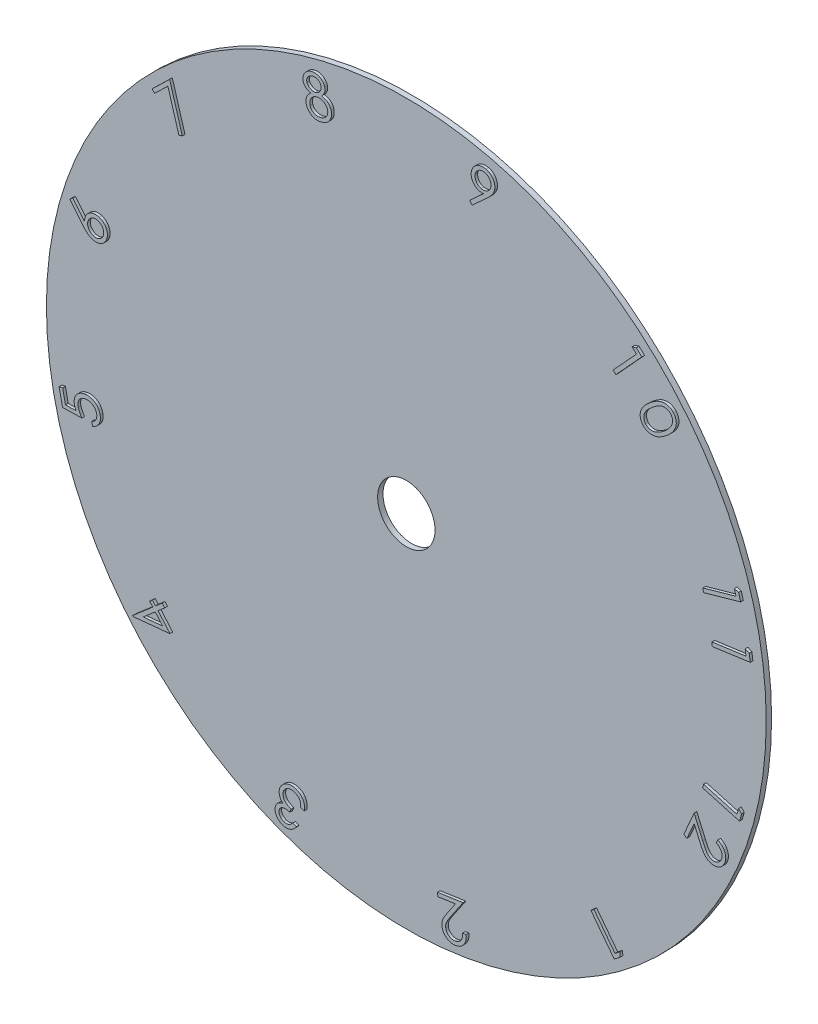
from build123d import *

# Parameters (mm, degrees)
SKETCH1_R           = 134.355713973
BASE_EXTRUDE_DEPTH  = 2
BOSS_EXTRUDE1_DEPTH = 1
SKETCH3_R           = 10.711126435
CUT_EXTRUDE1_DEPTH  = 191.018198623


with BuildPart() as part:
    # Sketch1 → Base-Extrude (new body)
    with BuildSketch(Plane.XY):
        Circle(SKETCH1_R)
    extrude(amount=BASE_EXTRUDE_DEPTH)

    # Sketch2 → Boss-Extrude1 (add)
    # profile 1 of 15: a face of its own
    with BuildSketch(Plane.XY.offset(2)):
        Polygon((128.998970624, 19.866427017), (129.384416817, 17.08488621), (115.235089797, 15.120261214), (115.039490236, 16.52685217), (127.802361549, 18.29875407), (127.494579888, 20.519384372), align=None)
    # profile 2 of 15: a face of its own
    with BuildSketch(Plane.XY.offset(2)):
        Polygon((125.024778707, 37.532719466), (125.795671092, 34.831719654), (112.043296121, 30.913975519), (111.654973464, 32.277419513), (124.061163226, 35.81259392), (123.445599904, 37.972818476), align=None)
    # profile 3 of 15: a face of its own
    with BuildSketch(Plane.XY.offset(2)):
        with BuildLine():
            add(Edge.make_bspline(
                [(91.977572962, 82.303282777), (92.153838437, 82.447567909), (92.496024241, 82.727669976), (93.013268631, 83.112589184), (93.509222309, 83.461303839), (93.986920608, 83.769582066), (94.444595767, 84.039513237), (94.885398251, 84.26578334), (95.304666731, 84.459813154), (95.711261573, 84.605508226), (96.101966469, 84.72257359), (96.483659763, 84.808978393), (96.857360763, 84.869852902), (97.222512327, 84.904386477), (97.579263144, 84.914693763), (97.928246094, 84.893139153), (98.270229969, 84.849187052), (98.602291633, 84.772216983), (98.922329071, 84.675315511), (99.231390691, 84.557815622), (99.522923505, 84.411113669), (99.807606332, 84.253259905), (100.071573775, 84.063472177), (100.32356651, 83.855193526), (100.563677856, 83.625750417), (100.709030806, 83.456112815), (100.782429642, 83.370450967)],
                knots=[0, 0, 0, 0, 1.643594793, 3.190725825, 4.651477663, 6.017995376, 7.292516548, 8.483943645, 9.592569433, 10.623528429, 11.597758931, 12.534382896, 13.445537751, 14.328188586, 15.179501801, 16.018123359, 16.848915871, 17.664705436, 18.474575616, 19.260961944, 20.046952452, 20.827932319, 21.607347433, 22.388725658, 23.186355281, 24, 24, 24, 24], degree=3))
            add(Edge.make_bspline(
                [(100.782429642, 83.370450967), (100.852882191, 83.281368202), (100.992978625, 83.104225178), (101.176476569, 82.822081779), (101.334764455, 82.530087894), (101.472052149, 82.230124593), (101.57990627, 81.918439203), (101.667655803, 81.598784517), (101.727228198, 81.268496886), (101.764636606, 80.930272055), (101.777836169, 80.583900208), (101.755373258, 80.232949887), (101.709706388, 79.877154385), (101.635501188, 79.516960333), (101.526209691, 79.154000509), (101.394373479, 78.784589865), (101.232645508, 78.411038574), (101.042057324, 78.031780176), (100.816532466, 77.648271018), (100.553730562, 77.258931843), (100.250521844, 76.864690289), (99.906234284, 76.464798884), (99.524891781, 76.057258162), (99.101881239, 75.645517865), (98.643742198, 75.225591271), (98.317445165, 74.95264733), (98.150464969, 74.812970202)],
                knots=[0, 0, 0, 0, 0.813469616, 1.617602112, 2.407701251, 3.191773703, 3.978340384, 4.768290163, 5.564666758, 6.380251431, 7.205129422, 8.044668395, 8.896818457, 9.773969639, 10.67616155, 11.610605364, 12.583067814, 13.590830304, 14.650106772, 15.768615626, 16.954471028, 18.211580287, 19.548229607, 20.952250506, 22.440335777, 24, 24, 24, 24], degree=3))
            add(Edge.make_bspline(
                [(98.150464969, 74.812970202), (97.981993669, 74.67521732), (97.653749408, 74.406823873), (97.153927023, 74.041601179), (96.675224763, 73.703926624), (96.204112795, 73.41098929), (95.748169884, 73.151139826), (95.304759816, 72.928865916), (94.875840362, 72.7432237), (94.459174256, 72.596117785), (94.054700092, 72.479917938), (93.659577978, 72.394030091), (93.2736895, 72.331876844), (92.895776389, 72.30081519), (92.527695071, 72.294554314), (92.167958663, 72.314129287), (91.817480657, 72.362254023), (91.477767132, 72.44158119), (91.149417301, 72.541093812), (90.835862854, 72.666198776), (90.533773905, 72.808571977), (90.25103449, 72.980800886), (89.976655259, 73.166674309), (89.722445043, 73.381544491), (89.477960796, 73.614031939), (89.330760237, 73.785693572), (89.256437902, 73.872366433)],
                knots=[0, 0, 0, 0, 1.56060438, 3.04063323, 4.439029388, 5.761423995, 7.017941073, 8.202057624, 9.317306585, 10.367915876, 11.36926761, 12.333784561, 13.266592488, 14.170690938, 15.051094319, 15.905238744, 16.752377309, 17.584873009, 18.405005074, 19.21085467, 20.004461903, 20.797055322, 21.583027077, 22.37904437, 23.181570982, 24, 24, 24, 24], degree=3))
            add(Edge.make_bspline(
                [(89.256437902, 73.872366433), (89.186998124, 73.960541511), (89.049411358, 74.135250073), (88.868055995, 74.413458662), (88.709114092, 74.699037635), (88.579947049, 74.996878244), (88.469649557, 75.299790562), (88.386369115, 75.613763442), (88.325336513, 75.935693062), (88.29144475, 76.266677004), (88.28224329, 76.604257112), (88.302243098, 76.945946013), (88.353461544, 77.291612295), (88.426499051, 77.641199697), (88.532237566, 77.994454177), (88.66422465, 78.351210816), (88.827048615, 78.710326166), (89.014431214, 79.077303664), (89.24060829, 79.449029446), (89.506103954, 79.829923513), (89.816269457, 80.217500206), (90.16515219, 80.618055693), (90.555455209, 81.029197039), (90.992669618, 81.444830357), (91.467053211, 81.875193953), (91.803990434, 82.157727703), (91.977572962, 82.303282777)],
                knots=[0, 0, 0, 0, 0.810584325, 1.606077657, 2.396729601, 3.169080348, 3.949190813, 4.72389932, 5.513336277, 6.314361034, 7.125182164, 7.951017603, 8.783797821, 9.647971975, 10.529194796, 11.445449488, 12.394358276, 13.376570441, 14.420926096, 15.535594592, 16.728990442, 18.005702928, 19.372872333, 20.823187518, 22.363377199, 24, 24, 24, 24], degree=3))
        make_face()
        with BuildLine():
            add(Edge.make_bspline(
                [(92.811747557, 81.250496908), (92.662478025, 81.125651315), (92.373575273, 80.884019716), (91.964199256, 80.520296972), (91.59050532, 80.171709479), (91.255513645, 79.833200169), (90.955028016, 79.509673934), (90.693965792, 79.195176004), (90.464628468, 78.898287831), (90.275206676, 78.608735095), (90.115566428, 78.327729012), (89.9808424, 78.050395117), (89.862709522, 77.777398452), (89.775504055, 77.502930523), (89.704739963, 77.232544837), (89.658423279, 76.963143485), (89.635106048, 76.6956176), (89.635836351, 76.347735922), (89.683033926, 75.93092074), (89.806558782, 75.459624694), (90.000628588, 75.026309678), (90.187403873, 74.776398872), (90.280459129, 74.651888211)],
                knots=[0, 0, 0, 0, 1.477605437, 2.859821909, 4.15786153, 5.357439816, 6.475593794, 7.509427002, 8.460327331, 9.322611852, 10.134486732, 10.912723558, 11.663219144, 12.390796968, 13.097154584, 13.784224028, 14.463846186, 15.133686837, 16.42336831, 17.636677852, 18.822544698, 20, 20, 20, 20], degree=3))
            add(Edge.make_bspline(
                [(90.280459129, 74.651888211), (90.384943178, 74.536489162), (90.593833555, 74.305776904), (90.979475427, 74.032814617), (91.410400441, 73.816451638), (91.806371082, 73.694702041), (92.141686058, 73.629437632), (92.404610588, 73.603588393), (92.673929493, 73.601955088), (92.950970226, 73.61849828), (93.234330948, 73.659814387), (93.524628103, 73.720599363), (93.821687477, 73.804018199), (94.01933903, 73.875855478), (94.120538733, 73.912636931)],
                knots=[0, 0, 0, 0, 1.334797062, 2.668601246, 4.032475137, 5.466286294, 6.213128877, 6.966853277, 7.73344751, 8.526268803, 9.350392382, 10.192618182, 11.074601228, 12, 12, 12, 12], degree=3))
            add(Edge.make_bspline(
                [(94.120538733, 73.912636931), (94.247769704, 73.960898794), (94.507410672, 74.059387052), (94.890724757, 74.240034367), (95.279389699, 74.44139051), (95.673000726, 74.666182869), (96.068170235, 74.920896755), (96.471605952, 75.196034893), (96.877857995, 75.499123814), (97.145374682, 75.715276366), (97.281772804, 75.825485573)],
                knots=[0, 0, 0, 0, 0.879510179, 1.794821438, 2.737538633, 3.709460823, 4.724097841, 5.776441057, 6.866279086, 8, 8, 8, 8], degree=3))
            add(Edge.make_bspline(
                [(97.281772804, 75.825485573), (97.415691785, 75.937875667), (97.677031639, 76.157202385), (98.049158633, 76.491103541), (98.391875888, 76.822862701), (98.708072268, 77.148651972), (98.994445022, 77.47265603), (99.252557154, 77.791985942), (99.488076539, 78.103927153), (99.688605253, 78.416242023), (99.865456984, 78.722372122), (100.017726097, 79.02275979), (100.145296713, 79.318667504), (100.250254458, 79.607050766), (100.324341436, 79.891537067), (100.378026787, 80.168075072), (100.403402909, 80.439729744), (100.407286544, 80.7875374), (100.361708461, 81.203721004), (100.238573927, 81.671812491), (100.046242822, 82.101974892), (99.861964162, 82.349401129), (99.76991427, 82.472994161)],
                knots=[0, 0, 0, 0, 1.328964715, 2.593444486, 3.79963132, 4.954287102, 6.043820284, 7.085391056, 8.075206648, 9.013271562, 9.904671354, 10.761954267, 11.571623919, 12.35314833, 13.092152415, 13.804061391, 14.492332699, 15.162933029, 16.445951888, 17.660565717, 18.831418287, 20, 20, 20, 20], degree=3))
            add(Edge.make_bspline(
                [(99.76991427, 82.472994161), (99.664438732, 82.588381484), (99.453493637, 82.819149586), (99.064485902, 83.092923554), (98.628209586, 83.308300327), (98.228545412, 83.429966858), (97.890310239, 83.495042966), (97.625792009, 83.524074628), (97.354377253, 83.52971388), (97.076599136, 83.511216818), (96.792246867, 83.47359251), (96.500660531, 83.416651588), (96.203758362, 83.333718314), (95.895887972, 83.234251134), (95.576816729, 83.101359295), (95.238457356, 82.940619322), (94.88356157, 82.739666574), (94.505728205, 82.509692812), (94.109022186, 82.244025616), (93.693321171, 81.944860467), (93.25634341, 81.612688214), (92.963493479, 81.374117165), (92.811747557, 81.250496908)],
                knots=[0, 0, 0, 0, 1.184946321, 2.369825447, 3.58842841, 4.869712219, 5.529859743, 6.204089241, 6.889097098, 7.589886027, 8.317359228, 9.067500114, 9.8451578, 10.658448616, 11.524340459, 12.469373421, 13.503245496, 14.621565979, 15.829933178, 17.129991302, 18.512848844, 20, 20, 20, 20], degree=3))
        make_face(mode=Mode.SUBTRACT)
    # profile 4 of 15: a face of its own
    with BuildSketch(Plane.XY.offset(2)):
        Polygon((86.861899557, 97.509117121), (88.938706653, 95.607774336), (79.242146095, 85.028139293), (78.192236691, 85.98887831), (86.939564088, 95.532986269), (85.279844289, 97.05463579), align=None)
    # profile 5 of 15: a face of its own
    with BuildSketch(Plane.XY.offset(2)):
        with BuildLine():
            Line((25.606764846, 113.009631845), (24.643149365, 114.022147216))
            Line((24.643149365, 114.022147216), (29.771884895, 118.791324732))
            add(Edge.make_bspline(
                [(29.771884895, 118.791324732), (29.639611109, 118.783497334), (29.380875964, 118.768186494), (29.000959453, 118.780644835), (28.639928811, 118.818974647), (28.40907598, 118.86802849), (28.2962588, 118.892000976)],
                knots=[0, 0, 0, 0, 1.070377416, 2.093719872, 3.068405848, 4, 4, 4, 4], degree=3))
            add(Edge.make_bspline(
                [(28.2962588, 118.892000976), (28.162189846, 118.928831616), (27.897731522, 119.001482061), (27.519535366, 119.152063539), (27.166098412, 119.336326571), (26.839894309, 119.557486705), (26.53534164, 119.80783715), (26.258198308, 120.095713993), (26.004916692, 120.415544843), (25.77881542, 120.765344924), (25.58573012, 121.135230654), (25.426754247, 121.517366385), (25.3163435, 121.910933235), (25.240226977, 122.311210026), (25.205709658, 122.71991644), (25.212564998, 123.136865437), (25.25708544, 123.562910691), (25.319252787, 123.845750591), (25.350759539, 123.989095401)],
                knots=[0, 0, 0, 0, 1.016698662, 2.005493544, 2.972011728, 3.927389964, 4.884029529, 5.851489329, 6.845249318, 7.864920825, 8.894176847, 9.894723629, 10.887294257, 11.879368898, 12.872137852, 13.882474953, 14.926826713, 16, 16, 16, 16], degree=3))
            add(Edge.make_bspline(
                [(25.350759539, 123.989095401), (25.403774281, 124.182788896), (25.508072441, 124.563850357), (25.756545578, 125.09478264), (26.055400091, 125.58567624), (26.423062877, 126.02232456), (26.843036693, 126.406621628), (27.314590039, 126.728002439), (27.830048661, 126.989717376), (28.387327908, 127.17946614), (28.966811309, 127.303019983), (29.55527593, 127.352796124), (30.145042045, 127.326357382), (30.530094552, 127.247545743), (30.72399452, 127.207858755)],
                knots=[0, 0, 0, 0, 1.034175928, 2.034578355, 3.011825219, 3.991484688, 4.968293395, 5.93957698, 6.926091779, 7.941216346, 8.967521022, 9.975062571, 10.980307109, 12, 12, 12, 12], degree=3))
            add(Edge.make_bspline(
                [(30.72399452, 127.207858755), (30.91170068, 127.155236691), (31.282242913, 127.051357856), (31.804826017, 126.811100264), (32.286429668, 126.505940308), (32.724653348, 126.140955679), (33.115808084, 125.726246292), (33.435527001, 125.25719299), (33.695429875, 124.749600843), (33.881797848, 124.204672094), (34.003707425, 123.640729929), (34.049649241, 123.069354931), (34.023321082, 122.497163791), (33.946782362, 122.123475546), (33.908240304, 121.935300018)],
                knots=[0, 0, 0, 0, 1.022283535, 2.018043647, 3.006869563, 4.007884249, 5.00524651, 5.989718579, 6.978095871, 7.990664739, 9.00469674, 9.999705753, 10.992726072, 12, 12, 12, 12], degree=3))
            add(Edge.make_bspline(
                [(33.908240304, 121.935300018), (33.869066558, 121.791435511), (33.789062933, 121.497624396), (33.609282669, 121.068038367), (33.39019876, 120.636576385), (33.169217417, 120.282220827), (32.969253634, 119.993534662), (32.795109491, 119.769063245), (32.602127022, 119.536107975), (32.38982079, 119.294720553), (32.155692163, 119.047239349), (31.902327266, 118.792342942), (31.631929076, 118.525613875), (31.440780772, 118.349691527), (31.342434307, 118.259178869)],
                knots=[0, 0, 0, 0, 1.178454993, 2.406731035, 3.675468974, 5.003758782, 5.706574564, 6.453021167, 7.250377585, 8.099521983, 8.99564451, 9.945016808, 10.942704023, 12, 12, 12, 12], degree=3))
            Line((31.342434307, 118.259178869), (25.606764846, 113.009631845))
        make_face()
        with BuildLine():
            add(Edge.make_bspline(
                [(28.914698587, 120.031080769), (29.015002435, 120.008734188), (29.212242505, 119.964791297), (29.511441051, 119.937640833), (29.805169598, 119.936886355), (30.094346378, 119.965744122), (30.377650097, 120.023669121), (30.656540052, 120.110472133), (30.9296841, 120.229348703), (31.194897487, 120.375474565), (31.447589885, 120.543154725), (31.676626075, 120.734337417), (31.887341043, 120.938052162), (32.067210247, 121.164473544), (32.228162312, 121.404908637), (32.363043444, 121.664324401), (32.473369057, 121.942156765), (32.526480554, 122.136072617), (32.553425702, 122.234452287)],
                knots=[0, 0, 0, 0, 1.041559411, 2.04814924, 3.040301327, 4.017850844, 4.990743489, 5.969066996, 6.975515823, 8.007217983, 9.037773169, 10.046569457, 11.030149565, 12.005421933, 12.973928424, 13.961540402, 14.965824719, 16, 16, 16, 16], degree=3))
            add(Edge.make_bspline(
                [(32.553425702, 122.234452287), (32.574270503, 122.33388025), (32.615503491, 122.530558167), (32.64758941, 122.827094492), (32.648513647, 123.119452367), (32.614417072, 123.406102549), (32.55911974, 123.689388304), (32.467339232, 123.967084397), (32.349647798, 124.240851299), (32.203411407, 124.506180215), (32.035171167, 124.757540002), (31.847609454, 124.989779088), (31.640445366, 125.197246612), (31.414144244, 125.379474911), (31.171295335, 125.538366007), (30.911645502, 125.674275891), (30.632885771, 125.784967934), (30.437905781, 125.837686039), (30.338548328, 125.86455001)],
                knots=[0, 0, 0, 0, 1.030638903, 2.038701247, 3.021600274, 3.990964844, 4.964326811, 5.946068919, 6.953003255, 7.985203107, 9.016255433, 10.01937338, 11.010285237, 11.986028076, 12.963128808, 13.951217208, 14.955985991, 16, 16, 16, 16], degree=3))
            add(Edge.make_bspline(
                [(30.338548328, 125.86455001), (30.239120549, 125.885394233), (30.042442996, 125.92662608), (29.745904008, 125.958720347), (29.453555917, 125.959613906), (29.166869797, 125.925630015), (28.882821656, 125.86973381), (28.603784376, 125.779115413), (28.329311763, 125.660679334), (28.063885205, 125.514607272), (27.812776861, 125.346105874), (27.5801855, 125.159821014), (27.37683006, 124.950679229), (27.192557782, 124.728031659), (27.035105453, 124.486448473), (26.901396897, 124.227180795), (26.791340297, 123.950609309), (26.738257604, 123.756685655), (26.711327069, 123.658302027)],
                knots=[0, 0, 0, 0, 1.032420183, 2.042224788, 3.026822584, 3.997862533, 4.972906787, 5.965626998, 6.974301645, 8.008285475, 9.041119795, 10.045971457, 11.03172681, 12.001591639, 12.980381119, 13.957032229, 14.96353758, 16, 16, 16, 16], degree=3))
            add(Edge.make_bspline(
                [(26.711327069, 123.658302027), (26.688959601, 123.558961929), (26.644775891, 123.362729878), (26.618022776, 123.065386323), (26.617075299, 122.773579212), (26.646181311, 122.486327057), (26.704399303, 122.203179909), (26.790079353, 121.922967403), (26.909680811, 121.649103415), (27.055659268, 121.38380936), (27.223558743, 121.131314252), (27.413597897, 120.902114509), (27.619305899, 120.694304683), (27.844700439, 120.514508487), (28.084398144, 120.352923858), (28.345400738, 120.222122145), (28.622293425, 120.110922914), (28.816282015, 120.057953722), (28.914698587, 120.031080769)],
                knots=[0, 0, 0, 0, 1.034027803, 2.042572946, 3.026906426, 3.996657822, 4.971440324, 5.960970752, 6.969374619, 8.003080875, 9.035637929, 10.046393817, 11.024969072, 12.00213592, 12.972523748, 13.957580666, 14.96381582, 16, 16, 16, 16], degree=3))
        make_face(mode=Mode.SUBTRACT)
    # profile 6 of 15: a face of its own
    with BuildSketch(Plane.XY.offset(2)):
        with BuildLine():
            add(Edge.make_bspline(
                [(-30.643406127, 120.206725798), (-30.515600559, 120.18016548), (-30.265264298, 120.128141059), (-29.903889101, 120.031086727), (-29.565667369, 119.91749872), (-29.250071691, 119.795311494), (-28.957063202, 119.660407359), (-28.689301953, 119.50910792), (-28.440392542, 119.350502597), (-28.14759003, 119.115539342), (-27.820091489, 118.793426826), (-27.494961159, 118.351039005), (-27.2365643, 117.856081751), (-27.124876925, 117.498236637), (-27.067961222, 117.315879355)],
                knots=[0, 0, 0, 0, 0.963010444, 1.886274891, 2.758759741, 3.594295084, 4.382391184, 5.13617812, 5.862198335, 6.557153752, 7.90280826, 9.238514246, 10.592751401, 12, 12, 12, 12], degree=3))
            add(Edge.make_bspline(
                [(-27.067961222, 117.315879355), (-27.035918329, 117.184025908), (-26.972765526, 116.924158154), (-26.918993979, 116.529292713), (-26.897403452, 116.137589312), (-26.915457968, 115.748528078), (-26.968001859, 115.362673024), (-27.053486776, 114.979967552), (-27.17848589, 114.600091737), (-27.286438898, 114.354215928), (-27.341225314, 114.229433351)],
                knots=[0, 0, 0, 0, 1.028104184, 2.026273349, 3.016150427, 3.998418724, 4.973994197, 5.965044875, 6.96725528, 8, 8, 8, 8], degree=3))
            add(Edge.make_bspline(
                [(-27.341225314, 114.229433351), (-27.41702131, 114.080497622), (-27.567735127, 113.784351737), (-27.860575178, 113.380736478), (-28.195907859, 113.012565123), (-28.579161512, 112.682146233), (-29.010495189, 112.391170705), (-29.488951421, 112.139145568), (-30.011115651, 111.916530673), (-30.383187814, 111.808372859), (-30.574370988, 111.752797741)],
                knots=[0, 0, 0, 0, 0.951607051, 1.892188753, 2.832532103, 3.786053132, 4.770147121, 5.79247988, 6.865702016, 8, 8, 8, 8], degree=3))
            add(Edge.make_bspline(
                [(-30.574370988, 111.752797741), (-30.759733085, 111.706504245), (-31.120167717, 111.616487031), (-31.657350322, 111.537142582), (-32.171531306, 111.500999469), (-32.662941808, 111.526699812), (-33.131708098, 111.592106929), (-33.575998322, 111.716036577), (-33.998853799, 111.883961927), (-34.390810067, 112.108252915), (-34.7526223, 112.363507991), (-35.086143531, 112.637774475), (-35.385897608, 112.930161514), (-35.648917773, 113.242917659), (-35.878606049, 113.572469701), (-36.070848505, 113.921936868), (-36.231858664, 114.288363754), (-36.308781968, 114.543970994), (-36.347434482, 114.672408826)],
                knots=[0, 0, 0, 0, 1.264872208, 2.459530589, 3.592224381, 4.673145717, 5.713291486, 6.720993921, 7.721142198, 8.719291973, 9.704260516, 10.651652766, 11.576856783, 12.473834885, 13.354748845, 14.23320948, 15.11222099, 16, 16, 16, 16], degree=3))
            add(Edge.make_bspline(
                [(-36.347434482, 114.672408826), (-36.391867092, 114.861295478), (-36.479468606, 115.233696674), (-36.504307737, 115.804086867), (-36.450800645, 116.365415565), (-36.33236754, 116.824546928), (-36.191362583, 117.185348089), (-36.058861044, 117.460176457), (-35.895334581, 117.733347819), (-35.708935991, 118.010368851), (-35.49201456, 118.28660427), (-35.246800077, 118.561979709), (-34.975564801, 118.838861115), (-34.781500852, 119.018600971), (-34.681961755, 119.110792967)],
                knots=[0, 0, 0, 0, 1.386721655, 2.734003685, 4.065345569, 5.412365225, 6.112254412, 6.836857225, 7.593903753, 8.389794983, 9.226109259, 10.106351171, 11.028711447, 12, 12, 12, 12], degree=3))
            add(Edge.make_bspline(
                [(-34.681961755, 119.110792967), (-34.866366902, 119.156402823), (-35.22220277, 119.244413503), (-35.720831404, 119.442134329), (-36.163874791, 119.689999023), (-36.552212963, 119.984422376), (-36.882889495, 120.320436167), (-37.154359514, 120.69066992), (-37.37115596, 121.091672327), (-37.461322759, 121.379470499), (-37.506649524, 121.524146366)],
                knots=[0, 0, 0, 0, 1.163333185, 2.24481627, 3.276281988, 4.265967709, 5.221781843, 6.155072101, 7.072556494, 8, 8, 8, 8], degree=3))
            add(Edge.make_bspline(
                [(-37.506649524, 121.524146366), (-37.540358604, 121.674942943), (-37.608256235, 121.978680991), (-37.61997284, 122.452700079), (-37.571064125, 122.938170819), (-37.452179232, 123.429238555), (-37.27129957, 123.912399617), (-37.019869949, 124.370062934), (-36.704373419, 124.793922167), (-36.328819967, 125.181586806), (-35.906854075, 125.527671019), (-35.442393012, 125.820593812), (-34.940938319, 126.057346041), (-34.585734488, 126.16625109), (-34.405821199, 126.221412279)],
                knots=[0, 0, 0, 0, 0.890894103, 1.794460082, 2.724353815, 3.703860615, 4.704935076, 5.696584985, 6.710346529, 7.748559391, 8.807550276, 9.855706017, 10.913899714, 12, 12, 12, 12], degree=3))
            add(Edge.make_bspline(
                [(-34.405821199, 126.221412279), (-34.228283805, 126.263323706), (-33.876345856, 126.346406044), (-33.338253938, 126.390814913), (-32.804025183, 126.367391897), (-32.279235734, 126.278633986), (-31.774080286, 126.126406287), (-31.29970049, 125.917635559), (-30.864465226, 125.645571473), (-30.474729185, 125.318502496), (-30.129058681, 124.953365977), (-29.84450088, 124.552705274), (-29.620361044, 124.123021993), (-29.523917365, 123.81744714), (-29.475561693, 123.664235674)],
                knots=[0, 0, 0, 0, 1.064634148, 2.110457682, 3.142202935, 4.181977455, 5.211667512, 6.217303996, 7.201251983, 8.199685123, 9.182580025, 10.130762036, 11.062787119, 12, 12, 12, 12], degree=3))
            add(Edge.make_bspline(
                [(-29.475561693, 123.664235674), (-29.440456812, 123.510610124), (-29.371507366, 123.208874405), (-29.345208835, 122.749478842), (-29.393379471, 122.299764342), (-29.506167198, 121.859605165), (-29.688393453, 121.428047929), (-29.939192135, 121.006509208), (-30.257689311, 120.591862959), (-30.511805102, 120.338129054), (-30.643406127, 120.206725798)],
                knots=[0, 0, 0, 0, 0.98126058, 1.92729247, 2.852837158, 3.790903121, 4.750120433, 5.763044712, 6.841529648, 8, 8, 8, 8], degree=3))
        make_face()
        with BuildLine():
            add(Edge.make_bspline(
                [(-34.106668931, 124.866597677), (-34.198263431, 124.839329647), (-34.378125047, 124.785784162), (-34.634865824, 124.681232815), (-34.874627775, 124.560387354), (-35.096887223, 124.42282251), (-35.300708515, 124.265172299), (-35.486508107, 124.090746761), (-35.655896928, 123.898701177), (-35.803423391, 123.69088213), (-35.928501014, 123.473202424), (-36.033854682, 123.253911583), (-36.113629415, 123.031604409), (-36.15953019, 122.8056891), (-36.192118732, 122.579891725), (-36.190096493, 122.350862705), (-36.1648802, 122.120398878), (-36.12942967, 121.968754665), (-36.111564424, 121.892333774)],
                knots=[0, 0, 0, 0, 1.148658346, 2.255588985, 3.328117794, 4.374293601, 5.393630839, 6.421410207, 7.4344681, 8.46785868, 9.480391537, 10.450000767, 11.390801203, 12.311245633, 13.217938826, 14.128801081, 15.057011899, 16, 16, 16, 16], degree=3))
            add(Edge.make_bspline(
                [(-36.111564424, 121.892333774), (-36.088445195, 121.816874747), (-36.04268187, 121.667507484), (-35.942366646, 121.455805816), (-35.821003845, 121.256189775), (-35.676153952, 121.067313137), (-35.506015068, 120.893197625), (-35.313903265, 120.729711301), (-35.097093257, 120.581159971), (-34.861831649, 120.444914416), (-34.614000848, 120.32717376), (-34.359265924, 120.235762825), (-34.103105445, 120.164058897), (-33.843196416, 120.126019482), (-33.583394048, 120.107039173), (-33.321373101, 120.116816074), (-33.057092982, 120.149950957), (-32.882857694, 120.193430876), (-32.795001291, 120.215355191)],
                knots=[0, 0, 0, 0, 0.923443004, 1.827907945, 2.735158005, 3.656207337, 4.609361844, 5.581517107, 6.606539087, 7.683414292, 8.76362285, 9.815311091, 10.850619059, 11.873608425, 12.886684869, 13.898078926, 14.940127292, 16, 16, 16, 16], degree=3))
            add(Edge.make_bspline(
                [(-32.795001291, 120.215355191), (-32.683604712, 120.249770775), (-32.461847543, 120.318281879), (-32.149113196, 120.474306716), (-31.857565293, 120.667748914), (-31.59031485, 120.897303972), (-31.356122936, 121.157798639), (-31.157045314, 121.441399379), (-31.00354408, 121.750225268), (-30.894148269, 122.075949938), (-30.820340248, 122.405880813), (-30.796259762, 122.731709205), (-30.80514427, 123.047333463), (-30.852870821, 123.248600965), (-30.876399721, 123.34782462)],
                knots=[0, 0, 0, 0, 1.031552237, 2.053511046, 3.083102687, 4.125199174, 5.165771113, 6.179043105, 7.185777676, 8.209288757, 9.217312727, 10.171799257, 11.098708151, 12, 12, 12, 12], degree=3))
            add(Edge.make_bspline(
                [(-30.876399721, 123.34782462), (-30.896949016, 123.416427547), (-30.93771097, 123.552509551), (-31.025097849, 123.746466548), (-31.134220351, 123.9284326), (-31.256251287, 124.10582191), (-31.404503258, 124.269512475), (-31.572725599, 124.421542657), (-31.758291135, 124.567152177), (-31.962317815, 124.700654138), (-32.183803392, 124.817136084), (-32.420758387, 124.905647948), (-32.670221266, 124.970224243), (-32.933939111, 125.004491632), (-33.21041274, 125.007739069), (-33.499243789, 124.991739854), (-33.800656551, 124.945011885), (-34.002548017, 124.893278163), (-34.106668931, 124.866597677)],
                knots=[0, 0, 0, 0, 0.861270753, 1.708432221, 2.551575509, 3.412846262, 4.29549933, 5.202192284, 6.139435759, 7.131688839, 8.133026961, 9.144685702, 10.169099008, 11.228345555, 12.336442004, 13.49253409, 14.706831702, 16, 16, 16, 16], degree=3))
        make_face(mode=Mode.SUBTRACT)
        with BuildLine():
            add(Edge.make_bspline(
                [(-32.435443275, 118.975599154), (-32.551162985, 118.94111957), (-32.778194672, 118.873473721), (-33.102112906, 118.740261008), (-33.402995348, 118.581870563), (-33.681285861, 118.396349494), (-33.93716426, 118.184987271), (-34.17553302, 117.952937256), (-34.384680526, 117.690567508), (-34.574265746, 117.411700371), (-34.732772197, 117.117716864), (-34.863984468, 116.819918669), (-34.963394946, 116.51975763), (-35.026105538, 116.216568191), (-35.058252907, 115.91300628), (-35.058660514, 115.608266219), (-35.024449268, 115.302340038), (-34.976515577, 115.101553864), (-34.952349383, 115.000325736)],
                knots=[0, 0, 0, 0, 1.108745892, 2.175259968, 3.211554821, 4.227853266, 5.241782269, 6.25704954, 7.27780437, 8.318544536, 9.351239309, 10.341318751, 11.30510996, 12.250080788, 13.180029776, 14.104917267, 15.044577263, 16, 16, 16, 16], degree=3))
            add(Edge.make_bspline(
                [(-34.952349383, 115.000325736), (-34.914042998, 114.876980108), (-34.837493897, 114.630493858), (-34.652549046, 114.28839663), (-34.431574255, 113.963761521), (-34.157479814, 113.672989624), (-33.846885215, 113.41664096), (-33.498605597, 113.210788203), (-33.122894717, 113.050806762), (-32.716808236, 112.945323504), (-32.287561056, 112.890500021), (-31.839621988, 112.893130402), (-31.374975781, 112.943252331), (-31.066500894, 113.019529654), (-30.908040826, 113.058712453)],
                knots=[0, 0, 0, 0, 0.924488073, 1.847439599, 2.776649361, 3.735404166, 4.703318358, 5.65645587, 6.627371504, 7.623398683, 8.656567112, 9.722706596, 10.830180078, 12, 12, 12, 12], degree=3))
            add(Edge.make_bspline(
                [(-30.908040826, 113.058712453), (-30.786441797, 113.093783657), (-30.548253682, 113.162481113), (-30.212437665, 113.302355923), (-29.901220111, 113.461211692), (-29.616873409, 113.640775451), (-29.359567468, 113.845419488), (-29.129942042, 114.071955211), (-28.926514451, 114.321829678), (-28.752135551, 114.591512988), (-28.607349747, 114.873575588), (-28.490930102, 115.16055223), (-28.404659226, 115.448583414), (-28.345520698, 115.738191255), (-28.31941934, 116.030572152), (-28.326588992, 116.324376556), (-28.359218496, 116.620802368), (-28.407125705, 116.814837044), (-28.431405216, 116.913174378)],
                knots=[0, 0, 0, 0, 1.185583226, 2.322319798, 3.403726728, 4.458506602, 5.469241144, 6.479855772, 7.476584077, 8.483835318, 9.484850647, 10.444618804, 11.383062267, 12.299729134, 13.211180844, 14.128200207, 15.05136647, 16, 16, 16, 16], degree=3))
            add(Edge.make_bspline(
                [(-28.431405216, 116.913174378), (-28.460204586, 117.00684687), (-28.517403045, 117.192889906), (-28.636056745, 117.458847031), (-28.783863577, 117.707047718), (-28.958196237, 117.93964128), (-29.160094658, 118.155261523), (-29.389827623, 118.355153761), (-29.646100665, 118.538846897), (-29.926284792, 118.704193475), (-30.221334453, 118.846603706), (-30.52455707, 118.95999136), (-30.832151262, 119.040236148), (-31.143829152, 119.094421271), (-31.462185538, 119.109322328), (-31.784661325, 119.098587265), (-32.111561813, 119.056063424), (-32.326571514, 119.002646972), (-32.435443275, 118.975599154)],
                knots=[0, 0, 0, 0, 0.942751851, 1.872400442, 2.795243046, 3.718224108, 4.66512351, 5.633242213, 6.645033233, 7.696097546, 8.761171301, 9.794992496, 10.806909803, 11.817479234, 12.834267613, 13.868665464, 14.920782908, 16, 16, 16, 16], degree=3))
        make_face(mode=Mode.SUBTRACT)
    # profile 7 of 15: a face of its own
    with BuildSketch(Plane.XY.offset(2)):
        Polygon((-93.898230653, 90.843995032), (-87.354274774, 97.183721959), (-82.62824422, 81.262493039), (-83.896764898, 80.874170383), (-88.007232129, 94.661062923), (-92.951873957, 89.868873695), align=None)
    # profile 8 of 15: a face of its own
    with BuildSketch(Plane.XY.offset(2)):
        with BuildLine():
            Line((-124.619599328, 39.830418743), (-123.54667821, 40.730752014))
            Line((-123.54667821, 40.730752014), (-119.096788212, 35.351764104))
            add(Edge.make_bspline(
                [(-119.096788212, 35.351764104), (-119.097713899, 35.484132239), (-119.099520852, 35.742516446), (-119.070656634, 36.119578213), (-119.015036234, 36.477255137), (-118.952234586, 36.704188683), (-118.921323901, 36.815884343)],
                knots=[0, 0, 0, 0, 1.072320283, 2.093182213, 3.06147295, 4, 4, 4, 4], degree=3))
            add(Edge.make_bspline(
                [(-118.921323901, 36.815884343), (-118.876688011, 36.947182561), (-118.788812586, 37.205671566), (-118.617930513, 37.57373918), (-118.413641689, 37.914278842), (-118.174674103, 38.227141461), (-117.907512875, 38.516011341), (-117.606424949, 38.776372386), (-117.271951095, 39.006353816), (-116.913172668, 39.212720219), (-116.533397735, 39.383638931), (-116.143459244, 39.517209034), (-115.746496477, 39.609809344), (-115.343652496, 39.662743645), (-114.934089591, 39.668990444), (-114.519699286, 39.642074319), (-114.09922612, 39.568252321), (-113.821758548, 39.492296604), (-113.680406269, 39.453601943)],
                knots=[0, 0, 0, 0, 1.017608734, 2.003383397, 2.972810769, 3.927377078, 4.888694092, 5.856868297, 6.843019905, 7.864589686, 8.89169857, 9.895678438, 10.886042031, 11.879677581, 12.872464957, 13.888587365, 14.924368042, 16, 16, 16, 16], degree=3))
            add(Edge.make_bspline(
                [(-113.680406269, 39.453601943), (-113.490560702, 39.388332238), (-113.117618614, 39.260113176), (-112.598455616, 38.989377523), (-112.130110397, 38.657449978), (-111.713304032, 38.270155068), (-111.354027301, 37.829883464), (-111.058693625, 37.344371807), (-110.832755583, 36.814169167), (-110.677344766, 36.249921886), (-110.587438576, 35.666662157), (-110.57283817, 35.077101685), (-110.633814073, 34.489155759), (-110.735523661, 34.108085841), (-110.786683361, 33.916408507)],
                knots=[0, 0, 0, 0, 1.03637239, 2.035901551, 3.013411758, 3.995095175, 4.967101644, 5.940975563, 6.922133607, 7.935616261, 8.958059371, 9.96424789, 10.976021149, 12, 12, 12, 12], degree=3))
            add(Edge.make_bspline(
                [(-110.786683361, 33.916408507), (-110.850201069, 33.734271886), (-110.975502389, 33.374971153), (-111.242492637, 32.870407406), (-111.572106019, 32.409705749), (-111.95729851, 31.991532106), (-112.392972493, 31.62970759), (-112.872571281, 31.332033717), (-113.393534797, 31.106970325), (-113.945836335, 30.950112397), (-114.515372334, 30.864629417), (-115.088227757, 30.849629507), (-115.659114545, 30.907079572), (-116.028656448, 31.006955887), (-116.214571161, 31.057203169)],
                knots=[0, 0, 0, 0, 1.015507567, 2.003290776, 2.996050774, 3.993749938, 4.991436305, 5.971680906, 6.958364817, 7.97247584, 8.98944081, 9.985257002, 10.986392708, 12, 12, 12, 12], degree=3))
            add(Edge.make_bspline(
                [(-116.214571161, 31.057203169), (-116.354844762, 31.103956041), (-116.640523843, 31.19917223), (-117.053119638, 31.403584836), (-117.468228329, 31.642751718), (-117.809110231, 31.880004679), (-118.080486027, 32.101833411), (-118.29815795, 32.283783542), (-118.514416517, 32.493869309), (-118.7441158, 32.717760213), (-118.977402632, 32.964961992), (-119.221088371, 33.229778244), (-119.466545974, 33.517341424), (-119.631138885, 33.716738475), (-119.715227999, 33.818608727)],
                knots=[0, 0, 0, 0, 1.174858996, 2.392699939, 3.653741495, 4.984602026, 5.68974679, 6.441718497, 7.240175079, 8.086894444, 8.993176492, 9.943325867, 10.949262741, 12, 12, 12, 12], degree=3))
            Line((-119.715227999, 33.818608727), (-124.619599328, 39.830418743))
        make_face()
        with BuildLine():
            add(Edge.make_bspline(
                [(-117.828267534, 36.125532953), (-117.85507623, 36.027203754), (-117.907691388, 35.834221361), (-117.953584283, 35.540216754), (-117.970959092, 35.250318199), (-117.960347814, 34.961890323), (-117.915893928, 34.676814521), (-117.844432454, 34.394276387), (-117.741425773, 34.115663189), (-117.614268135, 33.84231531), (-117.45991228, 33.582267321), (-117.283956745, 33.342841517), (-117.089390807, 33.125243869), (-116.877408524, 32.927993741), (-116.641319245, 32.759360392), (-116.391191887, 32.607157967), (-116.1186847, 32.484201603), (-115.928444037, 32.419121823), (-115.832001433, 32.386129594)],
                knots=[0, 0, 0, 0, 1.036824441, 2.03488754, 3.022395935, 3.989434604, 4.966712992, 5.953835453, 6.951134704, 7.985935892, 9.018709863, 10.024047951, 11.005605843, 11.986484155, 12.964542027, 13.953785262, 14.962670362, 16, 16, 16, 16], degree=3))
            add(Edge.make_bspline(
                [(-115.832001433, 32.386129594), (-115.733672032, 32.359320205), (-115.540689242, 32.306703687), (-115.246687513, 32.260820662), (-114.956778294, 32.243409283), (-114.668389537, 32.254154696), (-114.384086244, 32.297961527), (-114.102103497, 32.371192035), (-113.823460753, 32.471520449), (-113.551034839, 32.60092638), (-113.291242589, 32.75526074), (-113.049694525, 32.929587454), (-112.83233371, 33.123864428), (-112.63813496, 33.336071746), (-112.463676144, 33.565595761), (-112.319013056, 33.818817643), (-112.188464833, 34.086237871), (-112.126773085, 34.276990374), (-112.095474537, 34.373766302)],
                knots=[0, 0, 0, 0, 1.03877434, 2.038714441, 3.028079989, 3.996937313, 4.976053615, 5.95556047, 6.963927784, 7.991829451, 9.026545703, 10.04167035, 11.025074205, 11.993980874, 12.971826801, 13.957949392, 14.963990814, 16, 16, 16, 16], degree=3))
            add(Edge.make_bspline(
                [(-112.095474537, 34.373766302), (-112.068665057, 34.472095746), (-112.016048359, 34.665078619), (-111.970166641, 34.959079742), (-111.952750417, 35.248991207), (-111.963513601, 35.537371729), (-112.007253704, 35.821705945), (-112.080736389, 36.103571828), (-112.180229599, 36.383057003), (-112.313619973, 36.654096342), (-112.467674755, 36.913636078), (-112.638649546, 37.157001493), (-112.833486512, 37.373152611), (-113.045517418, 37.568778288), (-113.277147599, 37.740238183), (-113.528508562, 37.887752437), (-113.795686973, 38.017136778), (-113.986370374, 38.078938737), (-114.083111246, 38.110293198)],
                knots=[0, 0, 0, 0, 1.038909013, 2.038978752, 3.028472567, 3.997455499, 4.97669874, 5.956332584, 6.964830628, 7.997089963, 9.031940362, 10.041481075, 11.025012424, 11.994044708, 12.979858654, 13.957684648, 14.9638565, 16, 16, 16, 16], degree=3))
            add(Edge.make_bspline(
                [(-114.083111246, 38.110293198), (-114.181369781, 38.138353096), (-114.374903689, 38.193620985), (-114.670431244, 38.23808258), (-114.962142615, 38.255950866), (-115.251547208, 38.245341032), (-115.537639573, 38.200947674), (-115.820775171, 38.128553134), (-116.101652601, 38.027670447), (-116.374291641, 37.895728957), (-116.634150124, 37.741795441), (-116.875236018, 37.569035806), (-117.091210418, 37.375271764), (-117.286729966, 37.163095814), (-117.45821857, 36.931504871), (-117.605725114, 36.68013337), (-117.735111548, 36.41295782), (-117.796913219, 36.222274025), (-117.828267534, 36.125532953)],
                knots=[0, 0, 0, 0, 1.039253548, 2.046955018, 3.034460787, 4.011249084, 4.988524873, 5.975644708, 6.982116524, 8.021095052, 9.053866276, 10.053452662, 11.035007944, 12.002093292, 12.985926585, 13.961787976, 14.965938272, 16, 16, 16, 16], degree=3))
        make_face(mode=Mode.SUBTRACT)
    # profile 9 of 15: a face of its own
    with BuildSketch(Plane.XY.offset(2)):
        with BuildLine():
            Line((-128.613286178, -22.778474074), (-127.278606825, -22.49658059))
            Line((-127.278606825, -22.49658059), (-126.225820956, -27.490122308))
            Line((-126.225820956, -27.490122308), (-122.259176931, -27.383693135))
            add(Edge.make_bspline(
                [(-122.259176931, -27.383693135), (-122.330845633, -27.243551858), (-122.469426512, -26.972570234), (-122.643415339, -26.565879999), (-122.777191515, -26.174108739), (-122.841010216, -25.915269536), (-122.871863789, -25.790132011)],
                knots=[0, 0, 0, 0, 1.102817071, 2.132442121, 3.097116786, 4, 4, 4, 4], degree=3))
            add(Edge.make_bspline(
                [(-122.871863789, -25.790132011), (-122.900748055, -25.633291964), (-122.95751588, -25.325045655), (-122.990097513, -24.862601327), (-122.985146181, -24.412261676), (-122.923931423, -23.975369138), (-122.82874377, -23.550109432), (-122.681899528, -23.139352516), (-122.494601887, -22.739584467), (-122.261520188, -22.357181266), (-121.994455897, -21.995513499), (-121.688799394, -21.66957086), (-121.357357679, -21.373533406), (-120.992604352, -21.113433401), (-120.596121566, -20.889936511), (-120.171989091, -20.695006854), (-119.715267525, -20.540269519), (-119.397767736, -20.464253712), (-119.236013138, -20.425526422)],
                knots=[0, 0, 0, 0, 1.053134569, 2.069782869, 3.058421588, 4.02355217, 4.979571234, 5.933467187, 6.900011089, 7.892136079, 8.888198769, 9.865585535, 10.83957755, 11.820695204, 12.819595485, 13.843209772, 14.901193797, 16, 16, 16, 16], degree=3))
            add(Edge.make_bspline(
                [(-119.236013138, -20.425526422), (-119.008523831, -20.384637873), (-118.558888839, -20.303821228), (-117.87929229, -20.29469457), (-117.21226924, -20.361817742), (-116.672278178, -20.493075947), (-116.252881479, -20.634224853), (-115.951248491, -20.76070679), (-115.66398046, -20.905553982), (-115.387198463, -21.062435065), (-115.130302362, -21.245363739), (-114.884065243, -21.441777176), (-114.649622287, -21.654311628), (-114.432890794, -21.888177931), (-114.227267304, -22.133878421), (-114.043871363, -22.398464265), (-113.872208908, -22.674604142), (-113.721592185, -22.967906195), (-113.584458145, -23.27461705), (-113.468315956, -23.596209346), (-113.365450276, -23.931841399), (-113.31376948, -24.162618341), (-113.287485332, -24.279988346)],
                knots=[0, 0, 0, 0, 1.743881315, 3.446799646, 5.114950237, 6.798369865, 7.632311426, 8.457108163, 9.267103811, 10.062385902, 10.858294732, 11.646916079, 12.441769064, 13.24646621, 14.054418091, 14.860418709, 15.676772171, 16.509548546, 17.349604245, 18.213683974, 19.091504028, 20, 20, 20, 20], degree=3))
            add(Edge.make_bspline(
                [(-113.287485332, -24.279988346), (-113.260905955, -24.420562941), (-113.208746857, -24.69642509), (-113.176267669, -25.109671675), (-113.174203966, -25.512951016), (-113.212632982, -25.906682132), (-113.283546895, -26.291394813), (-113.394020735, -26.66519434), (-113.542185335, -27.028449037), (-113.722408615, -27.381144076), (-113.933617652, -27.715019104), (-114.171754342, -28.025649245), (-114.433706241, -28.31153584), (-114.722850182, -28.571324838), (-115.037692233, -28.8055001), (-115.379682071, -29.011953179), (-115.743714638, -29.198423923), (-116.001824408, -29.296075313), (-116.13230835, -29.345441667)],
                knots=[0, 0, 0, 0, 1.076095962, 2.111719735, 3.114849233, 4.10798645, 5.084624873, 6.055138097, 7.036113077, 8.033436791, 9.032508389, 10.005379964, 10.97581269, 11.946728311, 12.926773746, 13.924358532, 14.950687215, 16, 16, 16, 16], degree=3))
            Line((-116.13230835, -29.345441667), (-116.434337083, -27.907209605))
            add(Edge.make_bspline(
                [(-116.434337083, -27.907209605), (-116.311334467, -27.851156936), (-116.073940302, -27.742975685), (-115.750129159, -27.546919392), (-115.470716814, -27.330059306), (-115.232466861, -27.091073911), (-115.036357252, -26.824274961), (-114.867095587, -26.5363308), (-114.736099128, -26.218799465), (-114.633360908, -25.881889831), (-114.562750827, -25.531245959), (-114.539432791, -25.175986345), (-114.546880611, -24.820316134), (-114.589262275, -24.587415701), (-114.610658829, -24.469834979)],
                knots=[0, 0, 0, 0, 1.146181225, 2.212121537, 3.203192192, 4.140870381, 5.065040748, 6.005502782, 6.967980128, 7.971625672, 8.991136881, 9.994452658, 10.987491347, 12, 12, 12, 12], degree=3))
            add(Edge.make_bspline(
                [(-114.610658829, -24.469834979), (-114.638079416, -24.356976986), (-114.6920949, -24.13465939), (-114.811880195, -23.816835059), (-114.959245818, -23.517528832), (-115.137886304, -23.237066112), (-115.350477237, -22.977783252), (-115.589580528, -22.734080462), (-115.861738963, -22.513058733), (-116.159362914, -22.313083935), (-116.475567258, -22.138650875), (-116.805737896, -21.996125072), (-117.146134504, -21.889811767), (-117.496822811, -21.816915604), (-117.8572806, -21.781096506), (-118.227900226, -21.774049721), (-118.608458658, -21.806025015), (-118.862418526, -21.853836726), (-118.991513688, -21.878140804)],
                knots=[0, 0, 0, 0, 0.982849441, 1.93610325, 2.869399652, 3.804213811, 4.745214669, 5.704123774, 6.690823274, 7.708803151, 8.737286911, 9.744882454, 10.749069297, 11.752369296, 12.772872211, 13.812388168, 14.887973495, 16, 16, 16, 16], degree=3))
            add(Edge.make_bspline(
                [(-118.991513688, -21.878140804), (-119.106231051, -21.90473231), (-119.331807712, -21.957021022), (-119.653513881, -22.071168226), (-119.954978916, -22.204096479), (-120.22994725, -22.369353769), (-120.487697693, -22.550807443), (-120.718290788, -22.763447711), (-120.927333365, -22.998600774), (-121.11304924, -23.25551797), (-121.271898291, -23.531917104), (-121.398497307, -23.823484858), (-121.494464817, -24.128051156), (-121.557279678, -24.445400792), (-121.588911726, -24.775913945), (-121.587923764, -25.118664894), (-121.556743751, -25.474934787), (-121.511484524, -25.713742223), (-121.488284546, -25.836155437)],
                knots=[0, 0, 0, 0, 1.071243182, 2.106459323, 3.10266734, 4.065267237, 5.022151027, 5.967498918, 6.913491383, 7.882560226, 8.848321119, 9.809970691, 10.770708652, 11.749906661, 12.749626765, 13.788369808, 14.866313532, 16, 16, 16, 16], degree=3))
            add(Edge.make_bspline(
                [(-121.488284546, -25.836155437), (-121.464163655, -25.942114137), (-121.414721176, -26.159305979), (-121.303879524, -26.485463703), (-121.172829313, -26.825303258), (-121.010832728, -27.175129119), (-120.821930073, -27.535981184), (-120.610068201, -27.908935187), (-120.369869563, -28.293560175), (-120.194833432, -28.549296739), (-120.104705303, -28.680978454)],
                knots=[0, 0, 0, 0, 0.818746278, 1.678248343, 2.593741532, 3.56409582, 4.582530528, 5.663825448, 6.797076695, 8, 8, 8, 8], degree=3))
            Line((-120.104705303, -28.680978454), (-127.333259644, -28.847813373))
            Line((-127.333259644, -28.847813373), (-128.613286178, -22.778474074))
        make_face()
    # profile 10 of 15: a face of its own
    with BuildSketch(Plane.XY.offset(2)):
        Polygon((-101.023656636, -83.31022329), (-101.213503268, -83.091612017), (-93.659908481, -76.567791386), (-94.793235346, -75.253247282), (-93.751955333, -74.352914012), (-92.618628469, -75.667458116), (-90.098845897, -73.492851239), (-89.163995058, -74.574401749), (-91.683777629, -76.749008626), (-87.207999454, -81.932396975), align=None)
        Polygon((-92.725057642, -77.649341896), (-97.243982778, -81.552703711), (-89.966528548, -80.842217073), align=None, mode=Mode.SUBTRACT)
    # profile 11 of 15: a face of its own
    with BuildSketch(Plane.XY.offset(2)):
        with BuildLine():
            Line((-41.424936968, -120.264672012), (-40.064369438, -120.770929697))
            add(Edge.make_bspline(
                [(-40.064369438, -120.770929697), (-40.147096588, -120.892939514), (-40.309097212, -121.131865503), (-40.575177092, -121.462883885), (-40.851291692, -121.764513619), (-41.142593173, -122.032084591), (-41.445555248, -122.270259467), (-41.762786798, -122.474552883), (-42.091795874, -122.648271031), (-42.431913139, -122.789108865), (-42.778316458, -122.898580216), (-43.128107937, -122.973242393), (-43.478434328, -123.017090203), (-43.830820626, -123.028457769), (-44.185057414, -123.008133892), (-44.5413576, -122.956134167), (-44.898563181, -122.870079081), (-45.132364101, -122.788385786), (-45.250634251, -122.74706055)],
                knots=[0, 0, 0, 0, 1.17050875, 2.292151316, 3.370096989, 4.415756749, 5.430419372, 6.427551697, 7.408704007, 8.381812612, 9.347741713, 10.290328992, 11.218935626, 12.148603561, 13.086904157, 14.033666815, 15.005313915, 16, 16, 16, 16], degree=3))
            add(Edge.make_bspline(
                [(-45.250634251, -122.74706055), (-45.420601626, -122.678702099), (-45.756338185, -122.543673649), (-46.220445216, -122.262715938), (-46.64802889, -121.935798), (-47.028677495, -121.556749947), (-47.356736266, -121.140817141), (-47.623293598, -120.697654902), (-47.821724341, -120.229799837), (-47.953766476, -119.746940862), (-48.01589658, -119.258864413), (-48.017147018, -118.779385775), (-47.954387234, -118.311775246), (-47.856573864, -118.016020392), (-47.807810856, -117.868577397)],
                knots=[0, 0, 0, 0, 1.07758898, 2.128561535, 3.183699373, 4.242052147, 5.283817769, 6.297004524, 7.278916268, 8.268159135, 9.236329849, 10.168253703, 11.086817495, 12, 12, 12, 12], degree=3))
            add(Edge.make_bspline(
                [(-47.807810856, -117.868577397), (-47.751428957, -117.730449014), (-47.640263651, -117.458108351), (-47.405973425, -117.088650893), (-47.12992084, -116.760177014), (-46.811327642, -116.470261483), (-46.44047109, -116.232845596), (-46.028763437, -116.032587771), (-45.570335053, -115.876752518), (-45.245764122, -115.809343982), (-45.078046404, -115.774511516)],
                knots=[0, 0, 0, 0, 0.988679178, 1.949328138, 2.888874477, 3.830724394, 4.796293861, 5.801065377, 6.863729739, 8, 8, 8, 8], degree=3))
            add(Edge.make_bspline(
                [(-45.078046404, -115.774511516), (-45.208391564, -115.648433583), (-45.464382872, -115.400822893), (-45.779503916, -114.975415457), (-46.050130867, -114.530000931), (-46.172963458, -114.207180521), (-46.234384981, -114.045756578)],
                knots=[0, 0, 0, 0, 1.034118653, 2.030956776, 3.015394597, 4, 4, 4, 4], degree=3))
            add(Edge.make_bspline(
                [(-46.234384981, -114.045756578), (-46.270770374, -113.931218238), (-46.3428153, -113.704426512), (-46.417103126, -113.358903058), (-46.461173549, -113.015339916), (-46.472063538, -112.674496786), (-46.454847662, -112.336760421), (-46.409210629, -112.001551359), (-46.331050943, -111.668591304), (-46.257294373, -111.451594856), (-46.220002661, -111.341880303)],
                knots=[0, 0, 0, 0, 1.044833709, 2.068823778, 3.069106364, 4.053761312, 5.030793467, 6.007362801, 6.992512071, 8, 8, 8, 8], degree=3))
            add(Edge.make_bspline(
                [(-46.220002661, -111.341880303), (-46.142620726, -111.157162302), (-45.988231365, -110.788620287), (-45.664578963, -110.279564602), (-45.277243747, -109.809740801), (-44.898631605, -109.460099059), (-44.569546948, -109.205359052), (-44.310361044, -109.033455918), (-44.04437344, -108.878358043), (-43.767787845, -108.748476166), (-43.48611938, -108.630347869), (-43.194294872, -108.540815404), (-42.89628814, -108.463743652), (-42.487348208, -108.392475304), (-41.965250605, -108.35101819), (-41.332210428, -108.383803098), (-40.693193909, -108.497648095), (-40.278582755, -108.638248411), (-40.067245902, -108.70991563)],
                knots=[0, 0, 0, 0, 1.287647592, 2.569063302, 3.867089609, 5.199504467, 5.877473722, 6.545302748, 7.200832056, 7.858074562, 8.511594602, 9.165726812, 9.82160493, 10.492565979, 11.836446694, 13.184108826, 14.564675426, 16, 16, 16, 16], degree=3))
            add(Edge.make_bspline(
                [(-40.067245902, -108.70991563), (-39.927314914, -108.765360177), (-39.652593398, -108.874212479), (-39.263084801, -109.070163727), (-38.904049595, -109.292608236), (-38.57539545, -109.540804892), (-38.27480354, -109.812008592), (-38.002496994, -110.106978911), (-37.759499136, -110.427055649), (-37.550491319, -110.773125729), (-37.370963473, -111.139345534), (-37.226363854, -111.526352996), (-37.120241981, -111.933162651), (-37.05161647, -112.35990599), (-37.017984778, -112.80630475), (-37.01799191, -113.272688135), (-37.056116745, -113.759111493), (-37.107086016, -114.087269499), (-37.133252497, -114.255738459)],
                knots=[0, 0, 0, 0, 1.046940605, 2.055421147, 3.029232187, 3.981949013, 4.917219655, 5.842634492, 6.771338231, 7.70843936, 8.651317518, 9.605528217, 10.578081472, 11.57180058, 12.609002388, 13.689811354, 14.81400096, 16, 16, 16, 16], degree=3))
            Line((-37.133252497, -114.255738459), (-38.442043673, -113.766739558))
            add(Edge.make_bspline(
                [(-38.442043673, -113.766739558), (-38.43235586, -113.650799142), (-38.413562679, -113.425888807), (-38.403604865, -113.097399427), (-38.416839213, -112.788316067), (-38.440210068, -112.496812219), (-38.486145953, -112.224624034), (-38.549969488, -111.971800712), (-38.629088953, -111.737063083), (-38.698536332, -111.591532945), (-38.732566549, -111.520221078)],
                knots=[0, 0, 0, 0, 1.216421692, 2.359710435, 3.433175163, 4.449750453, 5.41557477, 6.31523723, 7.174441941, 8, 8, 8, 8], degree=3))
            add(Edge.make_bspline(
                [(-38.732566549, -111.520221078), (-38.780872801, -111.435830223), (-38.877605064, -111.266839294), (-39.050578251, -111.031106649), (-39.247948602, -110.814049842), (-39.467752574, -110.614923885), (-39.709283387, -110.433555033), (-39.975017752, -110.271860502), (-40.260670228, -110.124312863), (-40.464366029, -110.044720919), (-40.567750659, -110.004324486)],
                knots=[0, 0, 0, 0, 0.957713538, 1.917801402, 2.87439557, 3.844336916, 4.836484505, 5.846116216, 6.906808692, 8, 8, 8, 8], degree=3))
            add(Edge.make_bspline(
                [(-40.567750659, -110.004324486), (-40.686945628, -109.962820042), (-40.919760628, -109.881752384), (-41.273602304, -109.799350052), (-41.617827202, -109.745957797), (-41.956120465, -109.728208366), (-42.285909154, -109.744963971), (-42.609042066, -109.797233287), (-42.922848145, -109.88454104), (-43.226884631, -110.001134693), (-43.511773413, -110.148705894), (-43.778630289, -110.312211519), (-44.021393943, -110.496293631), (-44.23861009, -110.7023943), (-44.432313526, -110.927955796), (-44.602976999, -111.173129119), (-44.74744279, -111.439005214), (-44.823791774, -111.626817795), (-44.862311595, -111.721573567)],
                knots=[0, 0, 0, 0, 1.172123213, 2.28942436, 3.370579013, 4.405514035, 5.431551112, 6.433474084, 7.440770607, 8.453412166, 9.453590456, 10.4178834, 11.358800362, 12.278986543, 13.195152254, 14.117062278, 15.050014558, 16, 16, 16, 16], degree=3))
            add(Edge.make_bspline(
                [(-44.862311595, -111.721573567), (-44.90493579, -111.851894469), (-44.98975513, -112.111224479), (-45.040872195, -112.51871097), (-45.03898866, -112.932941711), (-44.975036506, -113.349281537), (-44.85543121, -113.755948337), (-44.680421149, -114.139888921), (-44.455539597, -114.497255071), (-44.21924735, -114.767633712), (-43.999012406, -114.973616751), (-43.801338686, -115.128311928), (-43.576437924, -115.286289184), (-43.32348829, -115.447363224), (-43.041534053, -115.607260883), (-42.731521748, -115.769102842), (-42.393876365, -115.932259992), (-42.156842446, -116.036981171), (-42.034747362, -116.090922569)],
                knots=[0, 0, 0, 0, 1.124740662, 2.23815982, 3.357254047, 4.520832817, 5.687822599, 6.830504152, 7.978310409, 9.145965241, 9.770486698, 10.454797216, 11.206944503, 12.028963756, 12.918476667, 13.870222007, 14.902961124, 16, 16, 16, 16], degree=3))
            Line((-42.034747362, -116.090922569), (-42.489228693, -117.316296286))
            add(Edge.make_bspline(
                [(-42.489228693, -117.316296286), (-42.640847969, -117.264651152), (-42.937638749, -117.16355715), (-43.390164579, -117.060846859), (-43.837984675, -117.012738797), (-44.273516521, -117.00988962), (-44.684953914, -117.047132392), (-45.059173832, -117.130217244), (-45.392568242, -117.252362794), (-45.680307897, -117.420986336), (-45.923746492, -117.62550031), (-46.130204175, -117.854729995), (-46.301817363, -118.110630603), (-46.381205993, -118.299469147), (-46.421355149, -118.394970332)],
                knots=[0, 0, 0, 0, 1.26975446, 2.485511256, 3.671241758, 4.834720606, 5.934899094, 6.940332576, 7.86683783, 8.739343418, 9.570821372, 10.378522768, 11.179971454, 12, 12, 12, 12], degree=3))
            add(Edge.make_bspline(
                [(-46.421355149, -118.394970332), (-46.446147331, -118.467344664), (-46.495036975, -118.610065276), (-46.536810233, -118.830690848), (-46.557532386, -119.051259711), (-46.555177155, -119.273210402), (-46.526019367, -119.496181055), (-46.47023572, -119.718454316), (-46.391237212, -119.941382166), (-46.292308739, -120.163760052), (-46.169916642, -120.378424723), (-46.024295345, -120.577345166), (-45.862678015, -120.763241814), (-45.681352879, -120.932709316), (-45.480635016, -121.086252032), (-45.26166837, -121.224897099), (-45.022007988, -121.345409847), (-44.853260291, -121.412671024), (-44.767388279, -121.446898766)],
                knots=[0, 0, 0, 0, 0.948902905, 1.871215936, 2.779903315, 3.696744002, 4.621206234, 5.565466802, 6.536957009, 7.554834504, 8.584137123, 9.598666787, 10.611168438, 11.638817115, 12.674709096, 13.744926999, 14.852442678, 16, 16, 16, 16], degree=3))
            add(Edge.make_bspline(
                [(-44.767388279, -121.446898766), (-44.625785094, -121.494258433), (-44.350103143, -121.5864612), (-43.921884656, -121.635773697), (-43.503061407, -121.620189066), (-43.160568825, -121.545575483), (-42.892893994, -121.445451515), (-42.687137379, -121.34745934), (-42.481663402, -121.221627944), (-42.269727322, -121.079021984), (-42.061639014, -120.907745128), (-41.849480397, -120.715834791), (-41.634426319, -120.501625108), (-41.495994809, -120.345045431), (-41.424936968, -120.264672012)],
                knots=[0, 0, 0, 0, 1.405023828, 2.735388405, 4.038798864, 5.34440367, 6.019714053, 6.731636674, 7.490061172, 8.290254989, 9.139103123, 10.029106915, 10.988327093, 12, 12, 12, 12], degree=3))
        make_face()
    # profile 12 of 15: a face of its own
    with BuildSketch(Plane.XY.offset(2)):
        with BuildLine():
            Line((21.975543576, -124.153034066), (23.330358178, -123.951681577))
            add(Edge.make_bspline(
                [(23.330358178, -123.951681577), (23.348018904, -124.124074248), (23.382692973, -124.462540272), (23.377914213, -124.965407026), (23.331785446, -125.449247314), (23.247756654, -125.917781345), (23.109522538, -126.366322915), (22.935329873, -126.800057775), (22.713627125, -127.214976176), (22.451829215, -127.608279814), (22.152886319, -127.971365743), (21.829598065, -128.302939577), (21.479085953, -128.593954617), (21.09965078, -128.842901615), (20.697713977, -129.05800179), (20.265898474, -129.225363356), (19.811179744, -129.361236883), (19.495780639, -129.417193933), (19.334949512, -129.445728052)],
                knots=[0, 0, 0, 0, 1.098658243, 2.157043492, 3.183539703, 4.179689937, 5.170701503, 6.155646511, 7.140666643, 8.149494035, 9.147944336, 10.120014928, 11.083387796, 12.031489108, 12.994689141, 13.969458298, 14.964568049, 16, 16, 16, 16], degree=3))
            add(Edge.make_bspline(
                [(19.334949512, -129.445728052), (19.175080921, -129.465993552), (18.862900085, -129.505566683), (18.398458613, -129.513198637), (17.951471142, -129.479516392), (17.521048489, -129.402738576), (17.109474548, -129.279157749), (16.712740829, -129.120352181), (16.337571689, -128.908585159), (15.98024827, -128.664362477), (15.651989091, -128.385484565), (15.353641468, -128.08676571), (15.093459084, -127.765078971), (14.867939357, -127.424175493), (14.677219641, -127.064150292), (14.52428761, -126.683164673), (14.404403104, -126.283765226), (14.356802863, -126.007062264), (14.332778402, -125.867406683)],
                knots=[0, 0, 0, 0, 1.125529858, 2.19786045, 3.239606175, 4.254298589, 5.246573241, 6.238327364, 7.234125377, 8.250829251, 9.258951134, 10.239779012, 11.197349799, 12.145188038, 13.092386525, 14.03932425, 15.010421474, 16, 16, 16, 16], degree=3))
            add(Edge.make_bspline(
                [(14.332778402, -125.867406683), (14.310542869, -125.668256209), (14.266461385, -125.273444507), (14.28828366, -124.678224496), (14.387390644, -124.092747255), (14.533679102, -123.609736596), (14.694811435, -123.213700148), (14.848016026, -122.887136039), (15.030812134, -122.531482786), (15.243169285, -122.147995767), (15.486463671, -121.735003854), (15.758981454, -121.293959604), (16.061543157, -120.823726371), (16.277569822, -120.504282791), (16.38945025, -120.338842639)],
                knots=[0, 0, 0, 0, 1.190344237, 2.359832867, 3.527736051, 4.712784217, 5.352267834, 6.069048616, 6.85697029, 7.729728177, 8.675300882, 9.706957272, 10.81243086, 12, 12, 12, 12], degree=3))
            Line((16.38945025, -120.338842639), (19.34070244, -116.012640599))
            Line((19.34070244, -116.012640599), (12.811128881, -116.9906384))
            Line((12.811128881, -116.9906384), (12.606899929, -115.624317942))
            Line((12.606899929, -115.624317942), (22.214290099, -114.186085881))
            Line((22.214290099, -114.186085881), (17.680982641, -120.833594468))
            add(Edge.make_bspline(
                [(17.680982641, -120.833594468), (17.571682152, -120.995634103), (17.361856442, -121.306703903), (17.059876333, -121.754291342), (16.796121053, -122.173270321), (16.560018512, -122.555602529), (16.358028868, -122.906425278), (16.183863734, -123.22025299), (16.046365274, -123.503659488), (15.898978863, -123.829301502), (15.771166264, -124.221188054), (15.67986776, -124.689672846), (15.655143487, -125.162618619), (15.6882042, -125.474493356), (15.704851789, -125.631536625)],
                knots=[0, 0, 0, 0, 1.322626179, 2.539064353, 3.653217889, 4.672484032, 5.579444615, 6.392396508, 7.100398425, 7.710414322, 8.81013612, 9.880273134, 10.932620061, 12, 12, 12, 12], degree=3))
            add(Edge.make_bspline(
                [(15.704851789, -125.631536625), (15.722117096, -125.728792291), (15.756198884, -125.920775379), (15.840106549, -126.199067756), (15.954078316, -126.460744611), (16.08851438, -126.711414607), (16.254682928, -126.943432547), (16.442121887, -127.165119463), (16.659657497, -127.368675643), (16.898837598, -127.557020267), (17.155815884, -127.723130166), (17.425231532, -127.861131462), (17.701343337, -127.975612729), (17.987499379, -128.054964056), (18.281215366, -128.108227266), (18.582780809, -128.128962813), (18.894031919, -128.129083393), (19.102128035, -128.101911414), (19.20838509, -128.088036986)],
                knots=[0, 0, 0, 0, 0.995884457, 1.965880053, 2.923499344, 3.871446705, 4.829456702, 5.796747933, 6.795680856, 7.828957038, 8.864584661, 9.876867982, 10.879120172, 11.874252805, 12.866561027, 13.885109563, 14.920104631, 16, 16, 16, 16], degree=3))
            add(Edge.make_bspline(
                [(19.20838509, -128.088036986), (19.319203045, -128.069379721), (19.536632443, -128.032773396), (19.848318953, -127.937144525), (20.143090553, -127.823818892), (20.419519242, -127.681911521), (20.674809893, -127.510366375), (20.916718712, -127.318166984), (21.134186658, -127.094904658), (21.334397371, -126.849049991), (21.511519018, -126.580628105), (21.662614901, -126.2907711), (21.783103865, -125.980665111), (21.877131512, -125.652200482), (21.948238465, -125.305299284), (21.982596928, -124.938151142), (21.995311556, -124.551802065), (21.982244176, -124.288201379), (21.975543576, -124.153034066)],
                knots=[0, 0, 0, 0, 1.006410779, 1.974619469, 2.916368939, 3.835165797, 4.752997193, 5.669862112, 6.599808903, 7.540852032, 8.508755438, 9.477574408, 10.465611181, 11.485730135, 12.537620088, 13.634955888, 14.787269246, 16, 16, 16, 16], degree=3))
        make_face()
    # profile 13 of 15: a face of its own
    with BuildSketch(Plane.XY.offset(2)):
        Polygon((80.844734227, -102.502376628), (78.612598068, -104.210996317), (69.917047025, -92.84033364), (71.044620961, -91.977394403), (78.888738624, -102.234865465), (80.675022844, -100.868545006), align=None)
    # profile 14 of 15: a face of its own
    with BuildSketch(Plane.XY.offset(2)):
        with BuildLine():
            Line((116.740433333, -47.62187581), (117.292714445, -46.367737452))
            add(Edge.make_bspline(
                [(117.292714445, -46.367737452), (117.447633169, -46.445564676), (117.750950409, -46.597943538), (118.172409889, -46.868501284), (118.558952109, -47.162970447), (118.907178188, -47.486600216), (119.213497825, -47.841811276), (119.486181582, -48.219789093), (119.720775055, -48.626979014), (119.90959331, -49.059552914), (120.064533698, -49.502961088), (120.166595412, -49.954824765), (120.2292391, -50.406173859), (120.240708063, -50.859601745), (120.202087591, -51.313495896), (120.117807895, -51.768935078), (119.989169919, -52.226136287), (119.868167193, -52.522504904), (119.806744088, -52.672946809)],
                knots=[0, 0, 0, 0, 1.100282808, 2.154256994, 3.174777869, 4.182816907, 5.166849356, 6.148562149, 7.138641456, 8.144471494, 9.141862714, 10.116659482, 11.081094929, 12.031240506, 12.990433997, 13.968514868, 14.968782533, 16, 16, 16, 16], degree=3))
            add(Edge.make_bspline(
                [(119.806744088, -52.672946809), (119.738221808, -52.818025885), (119.603726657, -53.102786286), (119.364674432, -53.500131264), (119.097941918, -53.860497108), (118.804998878, -54.183493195), (118.483037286, -54.468498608), (118.132304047, -54.712825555), (117.757954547, -54.925011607), (117.359268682, -55.092488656), (116.94922943, -55.220075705), (116.537973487, -55.314676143), (116.127196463, -55.362967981), (115.719676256, -55.372242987), (115.314055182, -55.339898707), (114.91000827, -55.268338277), (114.508683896, -55.152505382), (114.248571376, -55.047385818), (114.117098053, -54.994253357)],
                knots=[0, 0, 0, 0, 1.121688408, 2.201643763, 3.237101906, 4.253003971, 5.246003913, 6.237666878, 7.237527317, 8.250192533, 9.255547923, 10.238258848, 11.197345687, 12.143140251, 13.084908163, 14.038634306, 15.008631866, 16, 16, 16, 16], degree=3))
            add(Edge.make_bspline(
                [(114.117098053, -54.994253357), (113.937067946, -54.907887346), (113.579592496, -54.736395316), (113.091759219, -54.39634929), (112.647518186, -54.002570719), (112.314625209, -53.622689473), (112.068880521, -53.272714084), (111.87011511, -52.971823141), (111.665569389, -52.628271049), (111.458773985, -52.241794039), (111.234384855, -51.819412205), (111.009611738, -51.352515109), (110.773083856, -50.846501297), (110.616772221, -50.493832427), (110.53590022, -50.311369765)],
                knots=[0, 0, 0, 0, 1.186596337, 2.356156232, 3.524156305, 4.713055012, 5.351126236, 6.068005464, 6.858653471, 7.72931242, 8.676151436, 9.704526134, 10.812375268, 12, 12, 12, 12], degree=3))
            Line((110.53590022, -50.311369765), (108.450463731, -45.513427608))
            Line((108.450463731, -45.513427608), (105.801240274, -51.554002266))
            Line((105.801240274, -51.554002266), (104.538472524, -50.99884469))
            Line((104.538472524, -50.99884469), (108.438957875, -42.110570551))
            Line((108.438957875, -42.110570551), (111.646215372, -49.480071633))
            add(Edge.make_bspline(
                [(111.646215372, -49.480071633), (111.723013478, -49.659756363), (111.870640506, -50.005159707), (112.096638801, -50.495491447), (112.305050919, -50.944044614), (112.507652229, -51.345276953), (112.692740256, -51.70545501), (112.867741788, -52.01952291), (113.031877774, -52.288209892), (113.231019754, -52.584740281), (113.494027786, -52.901846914), (113.844710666, -53.225630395), (114.229164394, -53.501712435), (114.510892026, -53.639434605), (114.65212038, -53.708473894)],
                knots=[0, 0, 0, 0, 1.322422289, 2.542058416, 3.653848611, 4.669564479, 5.583823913, 6.39437302, 7.102198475, 7.714144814, 8.810872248, 9.880798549, 10.937657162, 12, 12, 12, 12], degree=3))
            add(Edge.make_bspline(
                [(114.65212038, -53.708473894), (114.743505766, -53.74578129), (114.924326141, -53.819599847), (115.203991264, -53.897176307), (115.48562988, -53.94309762), (115.768103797, -53.961511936), (116.052508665, -53.94583777), (116.338472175, -53.902133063), (116.627012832, -53.830648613), (116.912379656, -53.726556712), (117.18983388, -53.59820201), (117.452238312, -53.446980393), (117.692749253, -53.26869357), (117.914473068, -53.071385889), (118.114537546, -52.849486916), (118.296272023, -52.607407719), (118.458851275, -52.341794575), (118.547706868, -52.151329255), (118.592876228, -52.054507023)],
                knots=[0, 0, 0, 0, 0.995827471, 1.970401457, 2.921968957, 3.872304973, 4.822098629, 5.79127434, 6.788981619, 7.817710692, 8.852704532, 9.872010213, 10.869012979, 11.869767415, 12.863334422, 13.879648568, 14.92212841, 16, 16, 16, 16], degree=3))
            add(Edge.make_bspline(
                [(118.592876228, -52.054507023), (118.635080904, -51.950697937), (118.717882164, -51.74703512), (118.807070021, -51.434672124), (118.864204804, -51.124516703), (118.896456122, -50.815393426), (118.884696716, -50.507777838), (118.848344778, -50.202208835), (118.777989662, -49.898827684), (118.678078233, -49.597848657), (118.54610384, -49.304239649), (118.380412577, -49.023129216), (118.183006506, -48.755991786), (117.959567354, -48.497132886), (117.697084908, -48.260053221), (117.408361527, -48.031628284), (117.088984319, -47.814703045), (116.858489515, -47.68718748), (116.740433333, -47.62187581)],
                knots=[0, 0, 0, 0, 1.005284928, 1.97226627, 2.909058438, 3.833915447, 4.755121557, 5.66565322, 6.59259, 7.545101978, 8.508053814, 9.476298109, 10.467784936, 11.486244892, 12.539876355, 13.636629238, 14.789514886, 16, 16, 16, 16], degree=3))
        make_face()
    # profile 15 of 15: a face of its own
    with BuildSketch(Plane.XY.offset(2)):
        Polygon((126.140293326, -33.54227652), (125.380906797, -36.243276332), (111.628531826, -32.377308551), (112.011101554, -31.013864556), (124.417291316, -34.500139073), (125.024225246, -32.339914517), align=None)
    extrude(amount=BOSS_EXTRUDE1_DEPTH)

    # Sketch3 → Cut-Extrude1 (cut, through all)
    with BuildSketch(Plane.XY.offset(2)):
        Circle(SKETCH3_R)
    extrude(amount=-CUT_EXTRUDE1_DEPTH, mode=Mode.SUBTRACT)


solid = part.part
